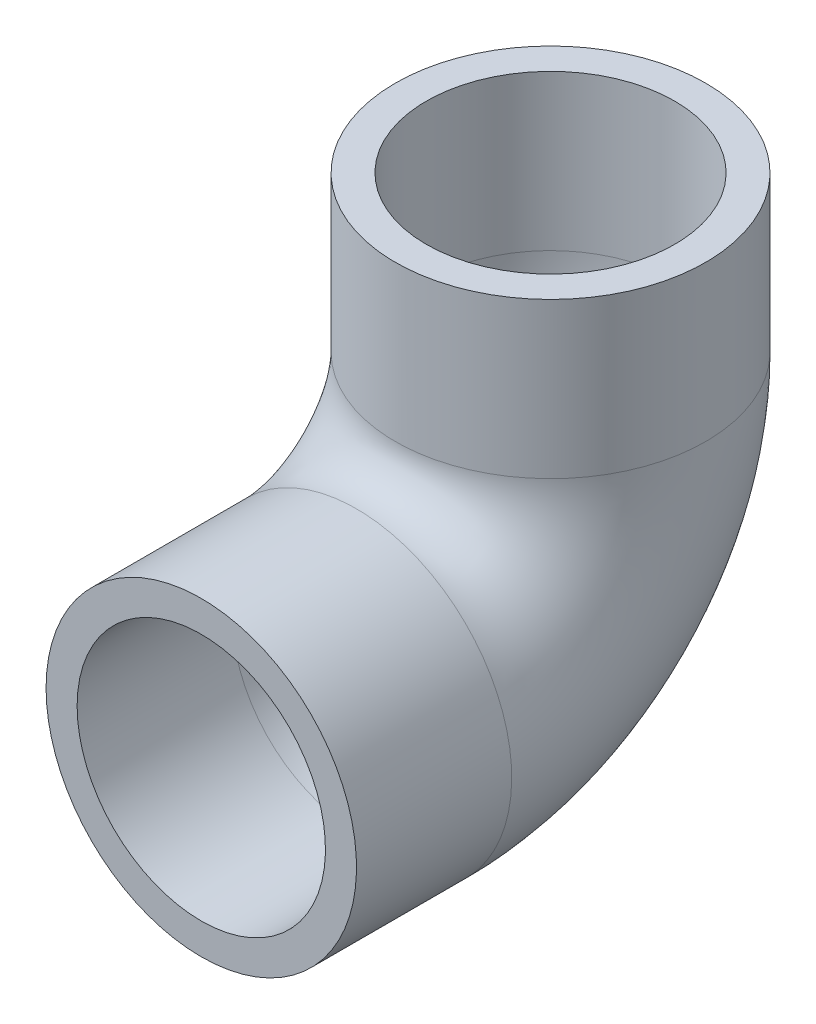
from build123d import *

# Parameters (mm, degrees)
SWEEP_THIN1_PROFILE_R   = 50.8
SWEEP_THIN1_PROFILE_R_2 = 40.64


with BuildPart() as part:
    # Sweep-Thin1: sweep along a path in Sketch1
    with BuildLine(Plane(origin=(0, 0, 0), x_dir=(0, 0, -1), z_dir=(1, 0, 0))) as sweep_thin1_path:
        Line((0, 0), (0, -50.8))
        ThreePointArc((0, -50.8), (-18.598719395, -95.701280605), (-63.5, -114.3))
        Line((-63.5, -114.3), (-114.3, -114.3))
    # Sweep-Thin1 profile (on start of the path) → Sweep-Thin1 (sweep)
    with BuildSketch(Plane(origin=(0, 0, 0), x_dir=(0, 0, -1), z_dir=(0, -1, 0))):
        Circle(SWEEP_THIN1_PROFILE_R)
        Circle(SWEEP_THIN1_PROFILE_R_2, mode=Mode.SUBTRACT)
    sweep(path=sweep_thin1_path.line)


solid = part.part
